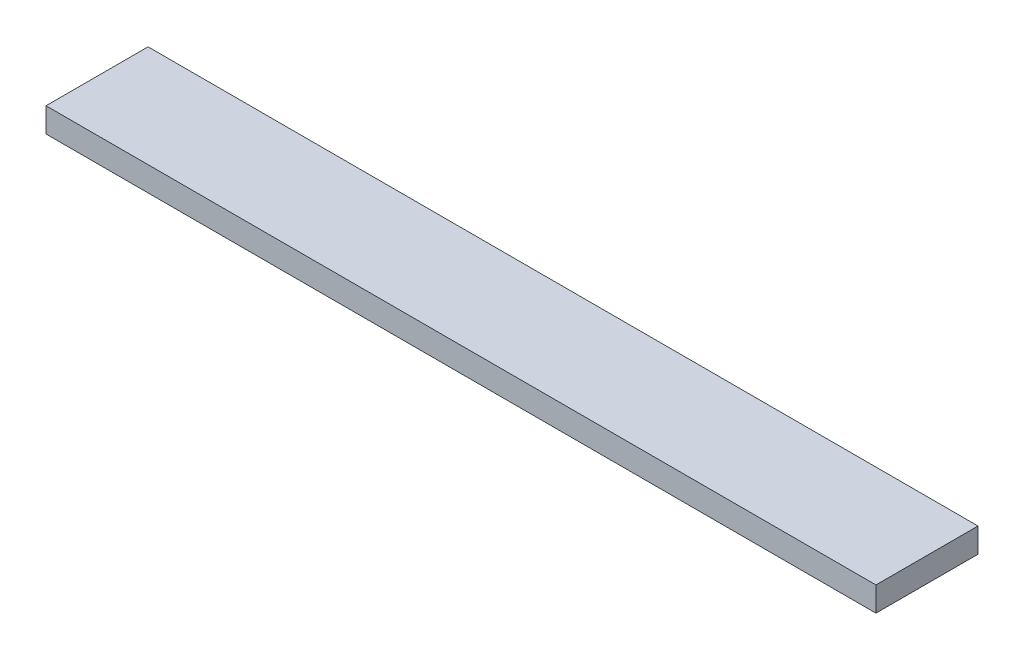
ISO-10303-21;
HEADER;
FILE_DESCRIPTION(('STEP AP214'),'2;1');
FILE_NAME('part.step','',(''),(''),'','','');
FILE_SCHEMA(('AUTOMOTIVE_DESIGN { 1 0 10303 214 1 1 1 1 }'));
ENDSEC;
DATA;
#1=APPLICATION_CONTEXT('core data for automotive mechanical design processes');
#2=APPLICATION_PROTOCOL_DEFINITION('international standard','automotive_design',2000,#1);
#3=PRODUCT_CONTEXT('',#1,'mechanical');
#4=PRODUCT('Part','Part','',(#3));
#5=PRODUCT_RELATED_PRODUCT_CATEGORY('part','',(#4));
#6=PRODUCT_DEFINITION_FORMATION('','',#4);
#7=PRODUCT_DEFINITION_CONTEXT('part definition',#1,'design');
#8=PRODUCT_DEFINITION('design','',#6,#7);
#9=PRODUCT_DEFINITION_SHAPE('','',#8);
#10=(LENGTH_UNIT() NAMED_UNIT(*) SI_UNIT(.MILLI.,.METRE.));
#11=(NAMED_UNIT(*) PLANE_ANGLE_UNIT() SI_UNIT($,.RADIAN.));
#12=(NAMED_UNIT(*) SI_UNIT($,.STERADIAN.) SOLID_ANGLE_UNIT());
#13=UNCERTAINTY_MEASURE_WITH_UNIT(LENGTH_MEASURE(1.E-05),#10,'distance_accuracy_value','');
#14=(GEOMETRIC_REPRESENTATION_CONTEXT(3) GLOBAL_UNCERTAINTY_ASSIGNED_CONTEXT((#13)) GLOBAL_UNIT_ASSIGNED_CONTEXT((#10,
#11,#12)) REPRESENTATION_CONTEXT('',''));
#15=CARTESIAN_POINT('',(0.,0.,0.));
#16=DIRECTION('',(0.,0.,1.));
#17=DIRECTION('',(1.,0.,0.));
#18=AXIS2_PLACEMENT_3D('',#15,#16,#17);
#19=CARTESIAN_POINT('',(0.,0.,52.07));
#20=DIRECTION('',(1.,0.,0.));
#21=DIRECTION('',(0.,0.,-1.));
#22=AXIS2_PLACEMENT_3D('',#19,#20,#21);
#23=PLANE('',#22);
#24=DIRECTION('',(0.,-1.,0.));
#25=VECTOR('',#24,1.);
#26=CARTESIAN_POINT('',(0.,0.,0.));
#27=LINE('',#26,#25);
#28=CARTESIAN_POINT('',(0.,12.4888709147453,0.));
#29=VERTEX_POINT('',#28);
#30=CARTESIAN_POINT('',(0.,0.,0.));
#31=VERTEX_POINT('',#30);
#32=EDGE_CURVE('E97',#29,#31,#27,.T.);
#33=ORIENTED_EDGE('',*,*,#32,.T.);
#34=DIRECTION('',(0.,0.,-1.));
#35=VECTOR('',#34,1.);
#36=CARTESIAN_POINT('',(0.,0.,52.07));
#37=LINE('',#36,#35);
#38=CARTESIAN_POINT('',(0.,0.,52.07));
#39=VERTEX_POINT('',#38);
#40=EDGE_CURVE('E11',#39,#31,#37,.T.);
#41=ORIENTED_EDGE('',*,*,#40,.F.);
#42=DIRECTION('',(0.,-1.,0.));
#43=VECTOR('',#42,1.);
#44=CARTESIAN_POINT('',(0.,0.,52.07));
#45=LINE('',#44,#43);
#46=CARTESIAN_POINT('',(0.,12.4888709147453,52.07));
#47=VERTEX_POINT('',#46);
#48=EDGE_CURVE('E85',#47,#39,#45,.T.);
#49=ORIENTED_EDGE('',*,*,#48,.F.);
#50=DIRECTION('',(0.,0.,-1.));
#51=VECTOR('',#50,1.);
#52=CARTESIAN_POINT('',(0.,12.4888709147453,52.07));
#53=LINE('',#52,#51);
#54=EDGE_CURVE('E93',#47,#29,#53,.T.);
#55=ORIENTED_EDGE('',*,*,#54,.T.);
#56=EDGE_LOOP('',(#33,#41,#49,#55));
#57=FACE_BOUND('',#56,.T.);
#58=ADVANCED_FACE('F34',(#57),#23,.F.);
#59=CARTESIAN_POINT('',(0.,0.,52.07));
#60=DIRECTION('',(0.,1.,0.));
#61=DIRECTION('',(0.,0.,1.));
#62=AXIS2_PLACEMENT_3D('',#59,#60,#61);
#63=PLANE('',#62);
#64=DIRECTION('',(1.,0.,0.));
#65=VECTOR('',#64,1.);
#66=CARTESIAN_POINT('',(0.,0.,0.));
#67=LINE('',#66,#65);
#68=CARTESIAN_POINT('',(423.434288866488,0.,0.));
#69=VERTEX_POINT('',#68);
#70=EDGE_CURVE('E89',#31,#69,#67,.T.);
#71=ORIENTED_EDGE('',*,*,#70,.T.);
#72=DIRECTION('',(0.,0.,-1.));
#73=VECTOR('',#72,1.);
#74=CARTESIAN_POINT('',(423.434288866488,0.,52.07));
#75=LINE('',#74,#73);
#76=CARTESIAN_POINT('',(423.434288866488,0.,52.07));
#77=VERTEX_POINT('',#76);
#78=EDGE_CURVE('E42',#77,#69,#75,.T.);
#79=ORIENTED_EDGE('',*,*,#78,.F.);
#80=DIRECTION('',(1.,0.,0.));
#81=VECTOR('',#80,1.);
#82=CARTESIAN_POINT('',(0.,0.,52.07));
#83=LINE('',#82,#81);
#84=EDGE_CURVE('E80',#39,#77,#83,.T.);
#85=ORIENTED_EDGE('',*,*,#84,.F.);
#86=ORIENTED_EDGE('',*,*,#40,.T.);
#87=EDGE_LOOP('',(#71,#79,#85,#86));
#88=FACE_BOUND('',#87,.T.);
#89=ADVANCED_FACE('F88',(#88),#63,.F.);
#90=CARTESIAN_POINT('',(423.434288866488,0.,52.07));
#91=DIRECTION('',(-1.,0.,0.));
#92=DIRECTION('',(0.,0.,1.));
#93=AXIS2_PLACEMENT_3D('',#90,#91,#92);
#94=PLANE('',#93);
#95=DIRECTION('',(0.,1.,0.));
#96=VECTOR('',#95,1.);
#97=CARTESIAN_POINT('',(423.434288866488,0.,0.));
#98=LINE('',#97,#96);
#99=CARTESIAN_POINT('',(423.434288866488,12.4888709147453,0.));
#100=VERTEX_POINT('',#99);
#101=EDGE_CURVE('E67',#69,#100,#98,.T.);
#102=ORIENTED_EDGE('',*,*,#101,.T.);
#103=DIRECTION('',(0.,0.,-1.));
#104=VECTOR('',#103,1.);
#105=CARTESIAN_POINT('',(423.434288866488,12.4888709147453,52.07));
#106=LINE('',#105,#104);
#107=CARTESIAN_POINT('',(423.434288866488,12.4888709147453,52.07));
#108=VERTEX_POINT('',#107);
#109=EDGE_CURVE('E90',#108,#100,#106,.T.);
#110=ORIENTED_EDGE('',*,*,#109,.F.);
#111=DIRECTION('',(0.,1.,0.));
#112=VECTOR('',#111,1.);
#113=CARTESIAN_POINT('',(423.434288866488,0.,52.07));
#114=LINE('',#113,#112);
#115=EDGE_CURVE('E83',#77,#108,#114,.T.);
#116=ORIENTED_EDGE('',*,*,#115,.F.);
#117=ORIENTED_EDGE('',*,*,#78,.T.);
#118=EDGE_LOOP('',(#102,#110,#116,#117));
#119=FACE_BOUND('',#118,.T.);
#120=ADVANCED_FACE('F91',(#119),#94,.F.);
#121=CARTESIAN_POINT('',(0.,12.4888709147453,52.07));
#122=DIRECTION('',(0.,-1.,0.));
#123=DIRECTION('',(0.,0.,-1.));
#124=AXIS2_PLACEMENT_3D('',#121,#122,#123);
#125=PLANE('',#124);
#126=DIRECTION('',(-1.,0.,0.));
#127=VECTOR('',#126,1.);
#128=CARTESIAN_POINT('',(0.,12.4888709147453,0.));
#129=LINE('',#128,#127);
#130=EDGE_CURVE('E73',#100,#29,#129,.T.);
#131=ORIENTED_EDGE('',*,*,#130,.T.);
#132=ORIENTED_EDGE('',*,*,#54,.F.);
#133=DIRECTION('',(-1.,0.,0.));
#134=VECTOR('',#133,1.);
#135=CARTESIAN_POINT('',(0.,12.4888709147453,52.07));
#136=LINE('',#135,#134);
#137=EDGE_CURVE('E50',#108,#47,#136,.T.);
#138=ORIENTED_EDGE('',*,*,#137,.F.);
#139=ORIENTED_EDGE('',*,*,#109,.T.);
#140=EDGE_LOOP('',(#131,#132,#138,#139));
#141=FACE_BOUND('',#140,.T.);
#142=ADVANCED_FACE('F104',(#141),#125,.F.);
#143=CARTESIAN_POINT('',(0.,12.4888709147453,52.07));
#144=DIRECTION('',(0.,0.,-1.));
#145=DIRECTION('',(-1.,0.,0.));
#146=AXIS2_PLACEMENT_3D('',#143,#144,#145);
#147=PLANE('',#146);
#148=ORIENTED_EDGE('',*,*,#48,.T.);
#149=ORIENTED_EDGE('',*,*,#84,.T.);
#150=ORIENTED_EDGE('',*,*,#115,.T.);
#151=ORIENTED_EDGE('',*,*,#137,.T.);
#152=EDGE_LOOP('',(#148,#149,#150,#151));
#153=FACE_BOUND('',#152,.T.);
#154=ADVANCED_FACE('F81',(#153),#147,.F.);
#155=CARTESIAN_POINT('',(0.,12.4888709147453,0.));
#156=DIRECTION('',(0.,0.,-1.));
#157=DIRECTION('',(-1.,0.,0.));
#158=AXIS2_PLACEMENT_3D('',#155,#156,#157);
#159=PLANE('',#158);
#160=ORIENTED_EDGE('',*,*,#32,.F.);
#161=ORIENTED_EDGE('',*,*,#130,.F.);
#162=ORIENTED_EDGE('',*,*,#101,.F.);
#163=ORIENTED_EDGE('',*,*,#70,.F.);
#164=EDGE_LOOP('',(#160,#161,#162,#163));
#165=FACE_BOUND('',#164,.T.);
#166=ADVANCED_FACE('F107',(#165),#159,.T.);
#167=CLOSED_SHELL('',(#58,#89,#120,#142,#154,#166));
#168=MANIFOLD_SOLID_BREP('B2',#167);
#169=ADVANCED_BREP_SHAPE_REPRESENTATION('',(#18,#168),#14);
#170=SHAPE_DEFINITION_REPRESENTATION(#9,#169);
ENDSEC;
END-ISO-10303-21;
